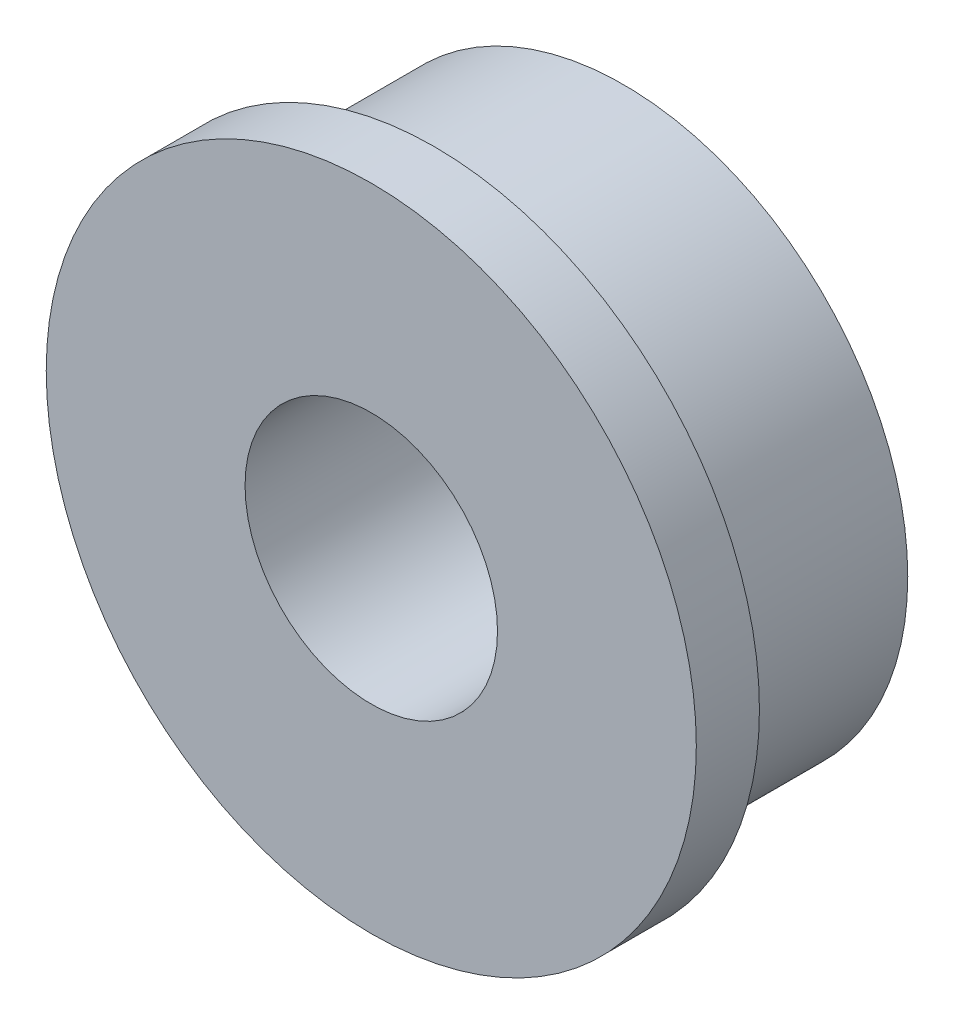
from build123d import *

# Parameters (mm, degrees)
SKETCH_1_R      = 4.5
SKETCH_1_R_2    = 2
EXTRUDE_1_DEPTH = 4
EXTRUDE_START   = -1
SKETCH_2_R      = 5.15
SKETCH_2_R_2    = 4.5
EXTRUDE_2_DEPTH = 1


with BuildPart() as part:
    # Sketch 1 → Extrude 1 (new body)
    with BuildSketch(Plane.XY):
        Circle(SKETCH_1_R)
        Circle(SKETCH_1_R_2, mode=Mode.SUBTRACT)
    extrude(amount=EXTRUDE_1_DEPTH)

    # Sketch 2 → Extrude 2 (add)
    with BuildSketch(Plane.XY.offset(4).offset(EXTRUDE_START)):
        Circle(SKETCH_2_R)
        Circle(SKETCH_2_R_2, mode=Mode.SUBTRACT)
    extrude(amount=EXTRUDE_2_DEPTH)


solid = part.part
